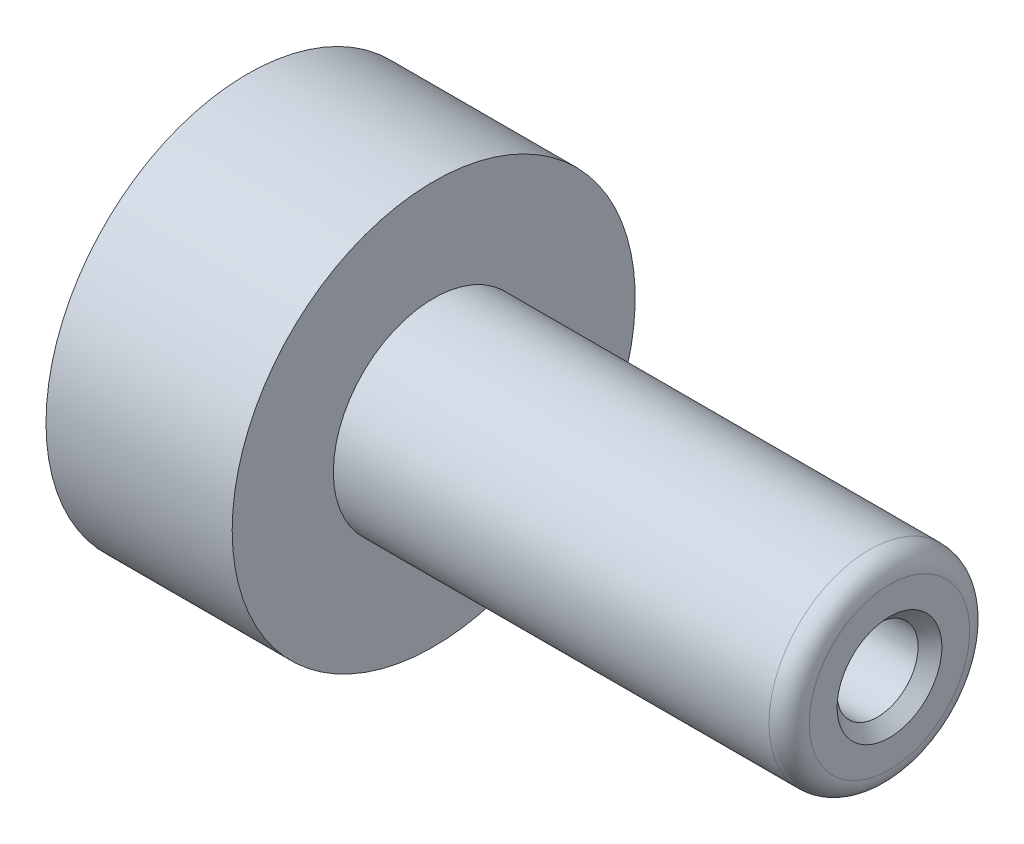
from build123d import *

# Parameters (mm, degrees)
SKETCH2_R          = 1.6129
CUT_EXTRUDE1_DEPTH = 6.35
SKETCH3_R          = 2.5527
CUT_EXTRUDE2_DEPTH = 15.7988
CHAMFER1_SIZE      = 0.7493


with BuildPart() as part:
    # Sketch1 → Revolve1 (revolve)
    with BuildSketch(Plane.XY, mode=Mode.PRIVATE) as revolve1_sk:
        with BuildLine():
            Line((0, 3.9751), (0, 12.7))
            Line((0, 12.7), (11.7348, 12.7))
            Line((11.7348, 12.7), (11.7348, 6.3246))
            Line((11.7348, 6.3246), (39.1922, 6.3246))
            ThreePointArc((39.1922, 6.3246), (40.090225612, 5.952625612), (40.4622, 5.0546))
            Line((40.4622, 5.0546), (40.4622, 0))
            Line((40.4622, 0), (21.7678, 0))
            Line((21.7678, 0), (21.7678, 3.9751))
            Line((21.7678, 3.9751), (0, 3.9751))
        make_face()
    revolve(revolve1_sk.sketch.rotate(Axis((0, 0, 0), (1, 0, 0)), 90), axis=Axis((0, 0, 0), (1, 0, 0)))

    # Sketch2 → Cut-Extrude1 (cut)
    with BuildSketch(Plane.ZY):
        with Locations((0, 7.1374)):
            Circle(SKETCH2_R)
        with Locations(Location((0, -7.1374, 0), (0, 0, 180))):
            Circle(SKETCH2_R)
    extrude(amount=-CUT_EXTRUDE1_DEPTH, mode=Mode.SUBTRACT)

    # Sketch3 → Cut-Extrude2 (cut)
    with BuildSketch(Plane(origin=(40.4622, 0, 0), x_dir=(0, 0, -1), z_dir=(1, 0, 0))):
        Circle(SKETCH3_R)
    extrude(amount=-CUT_EXTRUDE2_DEPTH, mode=Mode.SUBTRACT)

    # Chamfer1
    chamfer1_edges = [part.edges().sort_by_distance(p)[0] for p in [
        (40.4622, 0, 2.5527),
    ]]
    chamfer(chamfer1_edges, length=CHAMFER1_SIZE)


solid = part.part
